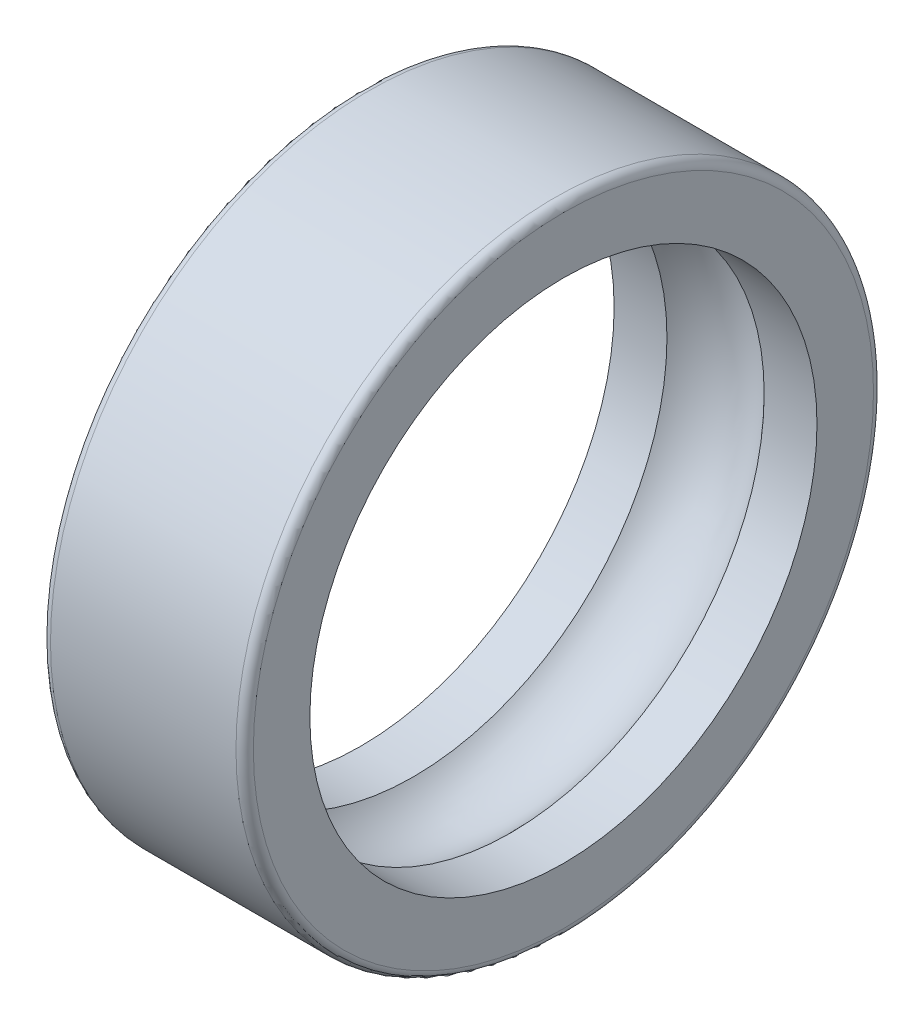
ISO-10303-21;
HEADER;
FILE_DESCRIPTION(('STEP AP214'),'2;1');
FILE_NAME('part.step','',(''),(''),'','','');
FILE_SCHEMA(('AUTOMOTIVE_DESIGN { 1 0 10303 214 1 1 1 1 }'));
ENDSEC;
DATA;
#1=APPLICATION_CONTEXT('core data for automotive mechanical design processes');
#2=APPLICATION_PROTOCOL_DEFINITION('international standard','automotive_design',2000,#1);
#3=PRODUCT_CONTEXT('',#1,'mechanical');
#4=PRODUCT('Part','Part','',(#3));
#5=PRODUCT_RELATED_PRODUCT_CATEGORY('part','',(#4));
#6=PRODUCT_DEFINITION_FORMATION('','',#4);
#7=PRODUCT_DEFINITION_CONTEXT('part definition',#1,'design');
#8=PRODUCT_DEFINITION('design','',#6,#7);
#9=PRODUCT_DEFINITION_SHAPE('','',#8);
#10=(LENGTH_UNIT() NAMED_UNIT(*) SI_UNIT(.MILLI.,.METRE.));
#11=(NAMED_UNIT(*) PLANE_ANGLE_UNIT() SI_UNIT($,.RADIAN.));
#12=(NAMED_UNIT(*) SI_UNIT($,.STERADIAN.) SOLID_ANGLE_UNIT());
#13=UNCERTAINTY_MEASURE_WITH_UNIT(LENGTH_MEASURE(1.E-05),#10,'distance_accuracy_value','');
#14=(GEOMETRIC_REPRESENTATION_CONTEXT(3) GLOBAL_UNCERTAINTY_ASSIGNED_CONTEXT((#13)) GLOBAL_UNIT_ASSIGNED_CONTEXT((#10,
#11,#12)) REPRESENTATION_CONTEXT('',''));
#15=CARTESIAN_POINT('',(0.,0.,0.));
#16=DIRECTION('',(0.,0.,1.));
#17=DIRECTION('',(1.,0.,0.));
#18=AXIS2_PLACEMENT_3D('',#15,#16,#17);
#19=CARTESIAN_POINT('',(0.3,0.,0.));
#20=DIRECTION('',(-1.,0.,0.));
#21=DIRECTION('',(0.,0.,1.));
#22=AXIS2_PLACEMENT_3D('',#19,#20,#21);
#23=TOROIDAL_SURFACE('',#22,10.7,0.3);
#24=CARTESIAN_POINT('',(0.,0.,0.));
#25=DIRECTION('',(-1.,0.,0.));
#26=DIRECTION('',(0.,0.,1.));
#27=AXIS2_PLACEMENT_3D('',#24,#25,#26);
#28=CIRCLE('',#27,10.7);
#29=CARTESIAN_POINT('',(0.,0.,10.7));
#30=VERTEX_POINT('',#29);
#31=EDGE_CURVE('E10',#30,#30,#28,.T.);
#32=ORIENTED_EDGE('',*,*,#31,.F.);
#33=EDGE_LOOP('',(#32));
#34=FACE_BOUND('',#33,.T.);
#35=CARTESIAN_POINT('',(0.3,0.,0.));
#36=DIRECTION('',(-1.,0.,0.));
#37=DIRECTION('',(0.,0.,1.));
#38=AXIS2_PLACEMENT_3D('',#35,#36,#37);
#39=CIRCLE('',#38,11.);
#40=CARTESIAN_POINT('',(0.3,0.,11.));
#41=VERTEX_POINT('',#40);
#42=EDGE_CURVE('E57',#41,#41,#39,.T.);
#43=ORIENTED_EDGE('',*,*,#42,.T.);
#44=EDGE_LOOP('',(#43));
#45=FACE_BOUND('',#44,.T.);
#46=ADVANCED_FACE('F29',(#34,#45),#23,.T.);
#47=CARTESIAN_POINT('',(0.,0.,-10.7));
#48=DIRECTION('',(1.,0.,0.));
#49=DIRECTION('',(0.,0.,-1.));
#50=AXIS2_PLACEMENT_3D('',#47,#48,#49);
#51=PLANE('',#50);
#52=CARTESIAN_POINT('',(0.,0.,0.));
#53=DIRECTION('',(-1.,0.,0.));
#54=DIRECTION('',(0.,0.,1.));
#55=AXIS2_PLACEMENT_3D('',#52,#53,#54);
#56=CIRCLE('',#55,8.75);
#57=CARTESIAN_POINT('',(0.,0.,8.75));
#58=VERTEX_POINT('',#57);
#59=EDGE_CURVE('E35',#58,#58,#56,.T.);
#60=ORIENTED_EDGE('',*,*,#59,.F.);
#61=EDGE_LOOP('',(#60));
#62=FACE_BOUND('',#61,.T.);
#63=ORIENTED_EDGE('',*,*,#31,.T.);
#64=EDGE_LOOP('',(#63));
#65=FACE_BOUND('',#64,.T.);
#66=ADVANCED_FACE('F94',(#62,#65),#51,.F.);
#67=CARTESIAN_POINT('',(0.,0.,0.));
#68=DIRECTION('',(-1.,0.,0.));
#69=DIRECTION('',(0.,0.,1.));
#70=AXIS2_PLACEMENT_3D('',#67,#68,#69);
#71=CYLINDRICAL_SURFACE('',#70,8.75);
#72=CARTESIAN_POINT('',(1.82294901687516,0.,0.));
#73=DIRECTION('',(-1.,0.,0.));
#74=DIRECTION('',(0.,0.,1.));
#75=AXIS2_PLACEMENT_3D('',#72,#73,#74);
#76=CIRCLE('',#75,8.75);
#77=CARTESIAN_POINT('',(1.82294901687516,0.,8.75));
#78=VERTEX_POINT('',#77);
#79=EDGE_CURVE('E39',#78,#78,#76,.T.);
#80=ORIENTED_EDGE('',*,*,#79,.F.);
#81=EDGE_LOOP('',(#80));
#82=FACE_BOUND('',#81,.T.);
#83=ORIENTED_EDGE('',*,*,#59,.T.);
#84=EDGE_LOOP('',(#83));
#85=FACE_BOUND('',#84,.T.);
#86=ADVANCED_FACE('F89',(#82,#85),#71,.F.);
#87=CARTESIAN_POINT('',(3.5,0.,0.));
#88=DIRECTION('',(-1.,0.,0.));
#89=DIRECTION('',(0.,0.,1.));
#90=AXIS2_PLACEMENT_3D('',#87,#88,#89);
#91=TOROIDAL_SURFACE('',#90,7.25,2.25);
#92=CARTESIAN_POINT('',(5.17705098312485,0.,0.));
#93=DIRECTION('',(-1.,0.,0.));
#94=DIRECTION('',(0.,0.,1.));
#95=AXIS2_PLACEMENT_3D('',#92,#93,#94);
#96=CIRCLE('',#95,8.75);
#97=CARTESIAN_POINT('',(5.17705098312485,0.,8.75));
#98=VERTEX_POINT('',#97);
#99=EDGE_CURVE('E43',#98,#98,#96,.T.);
#100=ORIENTED_EDGE('',*,*,#99,.F.);
#101=EDGE_LOOP('',(#100));
#102=FACE_BOUND('',#101,.T.);
#103=ORIENTED_EDGE('',*,*,#79,.T.);
#104=EDGE_LOOP('',(#103));
#105=FACE_BOUND('',#104,.T.);
#106=ADVANCED_FACE('F83',(#102,#105),#91,.F.);
#107=CARTESIAN_POINT('',(0.,0.,0.));
#108=DIRECTION('',(-1.,0.,0.));
#109=DIRECTION('',(0.,0.,1.));
#110=AXIS2_PLACEMENT_3D('',#107,#108,#109);
#111=CYLINDRICAL_SURFACE('',#110,8.75);
#112=CARTESIAN_POINT('',(7.,0.,0.));
#113=DIRECTION('',(-1.,0.,0.));
#114=DIRECTION('',(0.,0.,1.));
#115=AXIS2_PLACEMENT_3D('',#112,#113,#114);
#116=CIRCLE('',#115,8.75);
#117=CARTESIAN_POINT('',(7.,0.,8.75));
#118=VERTEX_POINT('',#117);
#119=EDGE_CURVE('E48',#118,#118,#116,.T.);
#120=ORIENTED_EDGE('',*,*,#119,.F.);
#121=EDGE_LOOP('',(#120));
#122=FACE_BOUND('',#121,.T.);
#123=ORIENTED_EDGE('',*,*,#99,.T.);
#124=EDGE_LOOP('',(#123));
#125=FACE_BOUND('',#124,.T.);
#126=ADVANCED_FACE('F77',(#122,#125),#111,.F.);
#127=CARTESIAN_POINT('',(7.,0.,-10.7));
#128=DIRECTION('',(-1.,0.,0.));
#129=DIRECTION('',(0.,0.,1.));
#130=AXIS2_PLACEMENT_3D('',#127,#128,#129);
#131=PLANE('',#130);
#132=CARTESIAN_POINT('',(7.,0.,0.));
#133=DIRECTION('',(-1.,0.,0.));
#134=DIRECTION('',(0.,0.,1.));
#135=AXIS2_PLACEMENT_3D('',#132,#133,#134);
#136=CIRCLE('',#135,10.7);
#137=CARTESIAN_POINT('',(7.,0.,10.7));
#138=VERTEX_POINT('',#137);
#139=EDGE_CURVE('E51',#138,#138,#136,.T.);
#140=ORIENTED_EDGE('',*,*,#139,.F.);
#141=EDGE_LOOP('',(#140));
#142=FACE_BOUND('',#141,.T.);
#143=ORIENTED_EDGE('',*,*,#119,.T.);
#144=EDGE_LOOP('',(#143));
#145=FACE_BOUND('',#144,.T.);
#146=ADVANCED_FACE('F71',(#142,#145),#131,.F.);
#147=CARTESIAN_POINT('',(6.7,0.,0.));
#148=DIRECTION('',(-1.,0.,0.));
#149=DIRECTION('',(0.,0.,1.));
#150=AXIS2_PLACEMENT_3D('',#147,#148,#149);
#151=TOROIDAL_SURFACE('',#150,10.7,0.3);
#152=CARTESIAN_POINT('',(6.7,0.,0.));
#153=DIRECTION('',(-1.,0.,0.));
#154=DIRECTION('',(0.,0.,1.));
#155=AXIS2_PLACEMENT_3D('',#152,#153,#154);
#156=CIRCLE('',#155,11.);
#157=CARTESIAN_POINT('',(6.7,0.,11.));
#158=VERTEX_POINT('',#157);
#159=EDGE_CURVE('E54',#158,#158,#156,.T.);
#160=ORIENTED_EDGE('',*,*,#159,.F.);
#161=EDGE_LOOP('',(#160));
#162=FACE_BOUND('',#161,.T.);
#163=ORIENTED_EDGE('',*,*,#139,.T.);
#164=EDGE_LOOP('',(#163));
#165=FACE_BOUND('',#164,.T.);
#166=ADVANCED_FACE('F65',(#162,#165),#151,.T.);
#167=CARTESIAN_POINT('',(0.,0.,0.));
#168=DIRECTION('',(-1.,0.,0.));
#169=DIRECTION('',(0.,0.,1.));
#170=AXIS2_PLACEMENT_3D('',#167,#168,#169);
#171=CYLINDRICAL_SURFACE('',#170,11.);
#172=ORIENTED_EDGE('',*,*,#42,.F.);
#173=EDGE_LOOP('',(#172));
#174=FACE_BOUND('',#173,.T.);
#175=ORIENTED_EDGE('',*,*,#159,.T.);
#176=EDGE_LOOP('',(#175));
#177=FACE_BOUND('',#176,.T.);
#178=ADVANCED_FACE('F62',(#174,#177),#171,.T.);
#179=CLOSED_SHELL('',(#46,#66,#86,#106,#126,#146,#166,#178));
#180=MANIFOLD_SOLID_BREP('B2',#179);
#181=ADVANCED_BREP_SHAPE_REPRESENTATION('',(#18,#180),#14);
#182=SHAPE_DEFINITION_REPRESENTATION(#9,#181);
ENDSEC;
END-ISO-10303-21;
